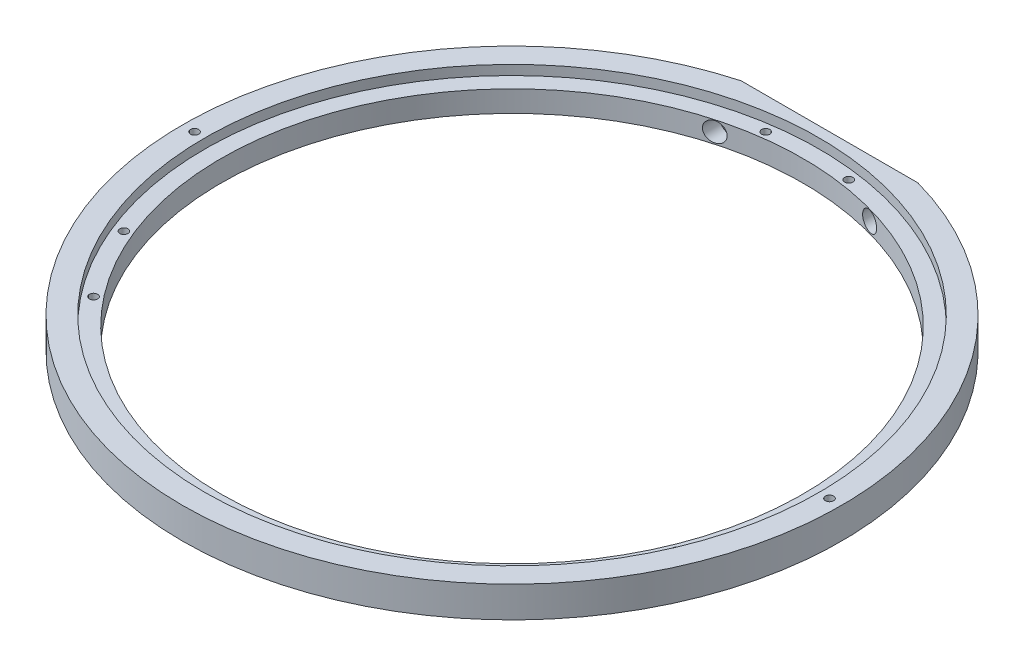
ISO-10303-21;
HEADER;
FILE_DESCRIPTION(('STEP AP214'),'2;1');
FILE_NAME('part.step','',(''),(''),'','','');
FILE_SCHEMA(('AUTOMOTIVE_DESIGN { 1 0 10303 214 1 1 1 1 }'));
ENDSEC;
DATA;
#1=APPLICATION_CONTEXT('core data for automotive mechanical design processes');
#2=APPLICATION_PROTOCOL_DEFINITION('international standard','automotive_design',2000,#1);
#3=PRODUCT_CONTEXT('',#1,'mechanical');
#4=PRODUCT('Part','Part','',(#3));
#5=PRODUCT_RELATED_PRODUCT_CATEGORY('part','',(#4));
#6=PRODUCT_DEFINITION_FORMATION('','',#4);
#7=PRODUCT_DEFINITION_CONTEXT('part definition',#1,'design');
#8=PRODUCT_DEFINITION('design','',#6,#7);
#9=PRODUCT_DEFINITION_SHAPE('','',#8);
#10=(LENGTH_UNIT() NAMED_UNIT(*) SI_UNIT(.MILLI.,.METRE.));
#11=(NAMED_UNIT(*) PLANE_ANGLE_UNIT() SI_UNIT($,.RADIAN.));
#12=(NAMED_UNIT(*) SI_UNIT($,.STERADIAN.) SOLID_ANGLE_UNIT());
#13=UNCERTAINTY_MEASURE_WITH_UNIT(LENGTH_MEASURE(1.E-05),#10,'distance_accuracy_value','');
#14=(GEOMETRIC_REPRESENTATION_CONTEXT(3) GLOBAL_UNCERTAINTY_ASSIGNED_CONTEXT((#13)) GLOBAL_UNIT_ASSIGNED_CONTEXT((#10,
#11,#12)) REPRESENTATION_CONTEXT('',''));
#15=CARTESIAN_POINT('',(0.,0.,0.));
#16=DIRECTION('',(0.,0.,1.));
#17=DIRECTION('',(1.,0.,0.));
#18=AXIS2_PLACEMENT_3D('',#15,#16,#17);
#19=CARTESIAN_POINT('',(0.,-25.4,0.));
#20=DIRECTION('',(0.,1.,0.));
#21=DIRECTION('',(0.,0.,1.));
#22=AXIS2_PLACEMENT_3D('',#19,#20,#21);
#23=CYLINDRICAL_SURFACE('',#22,238.506);
#24=CARTESIAN_POINT('',(-55.5625,-16.51,-231.943787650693));
#25=CARTESIAN_POINT('',(-55.562498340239,-16.7282810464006,-231.943787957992));
#26=CARTESIAN_POINT('',(-55.5715087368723,-16.9465369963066,-231.941630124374));
#27=CARTESIAN_POINT('',(-55.6074758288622,-17.3815515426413,-231.933009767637));
#28=CARTESIAN_POINT('',(-55.6344373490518,-17.5983097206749,-231.926546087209));
#29=CARTESIAN_POINT('',(-55.7061268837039,-18.0289295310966,-231.909337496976));
#30=CARTESIAN_POINT('',(-55.7508738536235,-18.2427878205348,-231.898588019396));
#31=CARTESIAN_POINT('',(-55.8577626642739,-18.6658565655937,-231.872864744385));
#32=CARTESIAN_POINT('',(-55.9199048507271,-18.8750669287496,-231.857890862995));
#33=CARTESIAN_POINT('',(-56.0609996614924,-19.2871500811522,-231.823815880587));
#34=CARTESIAN_POINT('',(-56.1399349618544,-19.4900291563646,-231.804719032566));
#35=CARTESIAN_POINT('',(-56.3140143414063,-19.8882751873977,-231.76249015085));
#36=CARTESIAN_POINT('',(-56.4091586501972,-20.0836420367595,-231.739358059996));
#37=CARTESIAN_POINT('',(-56.6148519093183,-20.465457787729,-231.689192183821));
#38=CARTESIAN_POINT('',(-56.7253944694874,-20.6519103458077,-231.662160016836));
#39=CARTESIAN_POINT('',(-56.9610870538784,-21.0148145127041,-231.604320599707));
#40=CARTESIAN_POINT('',(-57.086242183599,-21.1912625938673,-231.573512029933));
#41=CARTESIAN_POINT('',(-57.351558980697,-21.5347556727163,-231.50794712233));
#42=CARTESIAN_POINT('',(-57.4918650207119,-21.7016818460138,-231.473152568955));
#43=CARTESIAN_POINT('',(-57.7853535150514,-22.0230843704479,-231.40006012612));
#44=CARTESIAN_POINT('',(-57.9385406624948,-22.1775561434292,-231.361760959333));
#45=CARTESIAN_POINT('',(-58.2565837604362,-22.4730194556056,-231.281882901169));
#46=CARTESIAN_POINT('',(-58.4214387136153,-22.6140121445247,-231.240304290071));
#47=CARTESIAN_POINT('',(-58.7616286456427,-22.8817026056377,-231.154091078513));
#48=CARTESIAN_POINT('',(-58.9369640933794,-23.0083997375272,-231.109456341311));
#49=CARTESIAN_POINT('',(-59.3016031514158,-23.2499141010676,-231.016164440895));
#50=CARTESIAN_POINT('',(-59.4911529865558,-23.3643307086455,-230.96743231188));
#51=CARTESIAN_POINT('',(-59.8785932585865,-23.5766912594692,-230.86729118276));
#52=CARTESIAN_POINT('',(-60.0764840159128,-23.6746345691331,-230.815882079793));
#53=CARTESIAN_POINT('',(-60.4791835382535,-23.8535081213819,-230.710692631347));
#54=CARTESIAN_POINT('',(-60.6839918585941,-23.9344394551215,-230.656912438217));
#55=CARTESIAN_POINT('',(-61.0991942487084,-24.0789083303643,-230.547276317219));
#56=CARTESIAN_POINT('',(-61.309590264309,-24.1424397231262,-230.491419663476));
#57=CARTESIAN_POINT('',(-61.7409237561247,-24.2534254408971,-230.376261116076));
#58=CARTESIAN_POINT('',(-61.9619874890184,-24.3003344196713,-230.316906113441));
#59=CARTESIAN_POINT('',(-62.4070027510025,-24.3751250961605,-230.196722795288));
#60=CARTESIAN_POINT('',(-62.6309553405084,-24.4029995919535,-230.135893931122));
#61=CARTESIAN_POINT('',(-63.0800681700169,-24.4395844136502,-230.013197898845));
#62=CARTESIAN_POINT('',(-63.3052280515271,-24.4483001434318,-229.951331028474));
#63=CARTESIAN_POINT('',(-63.7553973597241,-24.4465840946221,-229.826925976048));
#64=CARTESIAN_POINT('',(-63.9804066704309,-24.4361435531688,-229.764387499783));
#65=CARTESIAN_POINT('',(-64.4339558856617,-24.3957264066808,-229.637614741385));
#66=CARTESIAN_POINT('',(-64.662453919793,-24.3652949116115,-229.573375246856));
#67=CARTESIAN_POINT('',(-65.1159065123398,-24.2846871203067,-229.445170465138));
#68=CARTESIAN_POINT('',(-65.3408625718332,-24.2345194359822,-229.381205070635));
#69=CARTESIAN_POINT('',(-65.7858669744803,-24.114724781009,-229.25397559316));
#70=CARTESIAN_POINT('',(-66.0059128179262,-24.0450881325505,-229.190711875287));
#71=CARTESIAN_POINT('',(-66.4393315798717,-23.8868177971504,-229.065445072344));
#72=CARTESIAN_POINT('',(-66.6527070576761,-23.7981915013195,-229.00344150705));
#73=CARTESIAN_POINT('',(-67.0721616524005,-23.602064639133,-228.880940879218));
#74=CARTESIAN_POINT('',(-67.2782084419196,-23.4944905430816,-228.820450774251));
#75=CARTESIAN_POINT('',(-67.6804845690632,-23.261405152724,-228.701788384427));
#76=CARTESIAN_POINT('',(-67.8767177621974,-23.1359009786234,-228.643615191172));
#77=CARTESIAN_POINT('',(-68.2580013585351,-22.8676475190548,-228.530078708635));
#78=CARTESIAN_POINT('',(-68.443047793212,-22.7248921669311,-228.474716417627));
#79=CARTESIAN_POINT('',(-68.800315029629,-22.4231391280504,-228.367387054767));
#80=CARTESIAN_POINT('',(-68.9725412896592,-22.2641484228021,-228.315418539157));
#81=CARTESIAN_POINT('',(-69.2989869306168,-21.9347739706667,-228.216543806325));
#82=CARTESIAN_POINT('',(-69.4535303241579,-21.7647381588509,-228.169548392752));
#83=CARTESIAN_POINT('',(-69.7477167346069,-21.411304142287,-228.079792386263));
#84=CARTESIAN_POINT('',(-69.8873658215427,-21.2279114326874,-228.037030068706));
#85=CARTESIAN_POINT('',(-70.1506035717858,-20.8489632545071,-227.956188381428));
#86=CARTESIAN_POINT('',(-70.2741922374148,-20.6534077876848,-227.918109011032));
#87=CARTESIAN_POINT('',(-70.5041659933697,-20.2515443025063,-227.847073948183));
#88=CARTESIAN_POINT('',(-70.6105517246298,-20.0452366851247,-227.814118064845));
#89=CARTESIAN_POINT('',(-70.8009689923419,-19.6323749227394,-227.755009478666));
#90=CARTESIAN_POINT('',(-70.8857572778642,-19.4262023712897,-227.728627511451));
#91=CARTESIAN_POINT('',(-71.0378437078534,-19.0069075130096,-227.681231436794));
#92=CARTESIAN_POINT('',(-71.105142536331,-18.7937854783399,-227.660217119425));
#93=CARTESIAN_POINT('',(-71.2216021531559,-18.3622176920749,-227.623810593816));
#94=CARTESIAN_POINT('',(-71.2707666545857,-18.1437730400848,-227.608417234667));
#95=CARTESIAN_POINT('',(-71.3504980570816,-17.7031888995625,-227.583435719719));
#96=CARTESIAN_POINT('',(-71.3810654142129,-17.4810495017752,-227.57384742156));
#97=CARTESIAN_POINT('',(-71.4224965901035,-17.0433193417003,-227.560847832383));
#98=CARTESIAN_POINT('',(-71.4340670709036,-16.8278017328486,-227.557215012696));
#99=CARTESIAN_POINT('',(-71.4396179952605,-16.3965201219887,-227.555472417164));
#100=CARTESIAN_POINT('',(-71.4335988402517,-16.1807561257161,-227.557362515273));
#101=CARTESIAN_POINT('',(-71.4040279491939,-15.750573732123,-227.566643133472));
#102=CARTESIAN_POINT('',(-71.3804778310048,-15.5361552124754,-227.574033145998));
#103=CARTESIAN_POINT('',(-71.3160634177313,-15.1101940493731,-227.594227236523));
#104=CARTESIAN_POINT('',(-71.2751990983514,-14.8986514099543,-227.60703132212));
#105=CARTESIAN_POINT('',(-71.1770890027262,-14.4823345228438,-227.637731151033));
#106=CARTESIAN_POINT('',(-71.12003486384,-14.2775106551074,-227.655567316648));
#107=CARTESIAN_POINT('',(-70.9898394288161,-13.8734726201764,-227.696199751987));
#108=CARTESIAN_POINT('',(-70.9166926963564,-13.6742603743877,-227.718997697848));
#109=CARTESIAN_POINT('',(-70.7549519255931,-13.2828633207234,-227.769304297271));
#110=CARTESIAN_POINT('',(-70.6663601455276,-13.0906774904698,-227.796812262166));
#111=CARTESIAN_POINT('',(-70.4744405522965,-12.7145196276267,-227.856260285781));
#112=CARTESIAN_POINT('',(-70.3711120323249,-12.5305479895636,-227.888200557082));
#113=CARTESIAN_POINT('',(-70.1481971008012,-12.1681585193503,-227.956917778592));
#114=CARTESIAN_POINT('',(-70.0283129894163,-11.9899405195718,-227.993782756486));
#115=CARTESIAN_POINT('',(-69.7749653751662,-11.6443422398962,-228.071444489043));
#116=CARTESIAN_POINT('',(-69.641501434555,-11.4769623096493,-228.112241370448));
#117=CARTESIAN_POINT('',(-69.3620064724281,-11.1540327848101,-228.197382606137));
#118=CARTESIAN_POINT('',(-69.2159759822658,-10.9984826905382,-228.241726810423));
#119=CARTESIAN_POINT('',(-68.9123438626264,-10.7000279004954,-228.333585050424));
#120=CARTESIAN_POINT('',(-68.7547381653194,-10.5571276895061,-228.381100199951));
#121=CARTESIAN_POINT('',(-68.4225019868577,-10.2792980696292,-228.480862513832));
#122=CARTESIAN_POINT('',(-68.2474408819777,-10.144924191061,-228.533223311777));
#123=CARTESIAN_POINT('',(-67.8872155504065,-9.89148320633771,-228.640489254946));
#124=CARTESIAN_POINT('',(-67.7020477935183,-9.77242149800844,-228.695395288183));
#125=CARTESIAN_POINT('',(-67.3229474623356,-9.55031322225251,-228.807280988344));
#126=CARTESIAN_POINT('',(-67.1290149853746,-9.44726647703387,-228.864260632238));
#127=CARTESIAN_POINT('',(-66.7336811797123,-9.25774046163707,-228.97984680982));
#128=CARTESIAN_POINT('',(-66.5322796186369,-9.17126170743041,-229.03845339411));
#129=CARTESIAN_POINT('',(-66.1152929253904,-9.01227567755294,-229.159178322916));
#130=CARTESIAN_POINT('',(-65.8994613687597,-8.94045012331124,-229.221344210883));
#131=CARTESIAN_POINT('',(-65.4627195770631,-8.81563811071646,-229.346454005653));
#132=CARTESIAN_POINT('',(-65.2418109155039,-8.76264589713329,-229.409397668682));
#133=CARTESIAN_POINT('',(-64.7962556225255,-8.67576956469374,-229.535641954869));
#134=CARTESIAN_POINT('',(-64.5716073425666,-8.64189411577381,-229.598942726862));
#135=CARTESIAN_POINT('',(-64.120275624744,-8.59351982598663,-229.725395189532));
#136=CARTESIAN_POINT('',(-63.8935928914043,-8.57901451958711,-229.788546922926));
#137=CARTESIAN_POINT('',(-63.4352436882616,-8.56939101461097,-229.915505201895));
#138=CARTESIAN_POINT('',(-63.2035659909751,-8.57465513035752,-229.979300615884));
#139=CARTESIAN_POINT('',(-62.7412762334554,-8.60545007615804,-230.105848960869));
#140=CARTESIAN_POINT('',(-62.5106641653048,-8.63098075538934,-230.168601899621));
#141=CARTESIAN_POINT('',(-62.0521629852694,-8.70221544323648,-230.292634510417));
#142=CARTESIAN_POINT('',(-61.8242739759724,-8.74792020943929,-230.353914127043));
#143=CARTESIAN_POINT('',(-61.3729179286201,-8.85928395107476,-230.474578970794));
#144=CARTESIAN_POINT('',(-61.1494507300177,-8.92494220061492,-230.533964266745));
#145=CARTESIAN_POINT('',(-60.7100957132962,-9.07535857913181,-230.650054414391));
#146=CARTESIAN_POINT('',(-60.4941671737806,-9.15998591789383,-230.706774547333));
#147=CARTESIAN_POINT('',(-60.0700641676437,-9.34807049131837,-230.817563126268));
#148=CARTESIAN_POINT('',(-59.8618867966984,-9.45152058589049,-230.871632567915));
#149=CARTESIAN_POINT('',(-59.4548268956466,-9.67665676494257,-230.976794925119));
#150=CARTESIAN_POINT('',(-59.2559449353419,-9.79834396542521,-231.027887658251));
#151=CARTESIAN_POINT('',(-58.869104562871,-10.0591760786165,-231.126762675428));
#152=CARTESIAN_POINT('',(-58.681145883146,-10.1983205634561,-231.174545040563));
#153=CARTESIAN_POINT('',(-58.3224708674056,-10.4892837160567,-231.265290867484));
#154=CARTESIAN_POINT('',(-58.1514323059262,-10.6406761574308,-231.308347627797));
#155=CARTESIAN_POINT('',(-57.822595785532,-10.9581343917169,-231.390769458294));
#156=CARTESIAN_POINT('',(-57.6647974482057,-11.1241997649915,-231.43013463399));
#157=CARTESIAN_POINT('',(-57.3637372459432,-11.4698881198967,-231.504941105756));
#158=CARTESIAN_POINT('',(-57.2204774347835,-11.6495130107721,-231.540381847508));
#159=CARTESIAN_POINT('',(-56.9497530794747,-12.0210142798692,-231.607117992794));
#160=CARTESIAN_POINT('',(-56.8222879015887,-12.2128901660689,-231.63841356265));
#161=CARTESIAN_POINT('',(-56.5879327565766,-12.601406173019,-231.695774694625));
#162=CARTESIAN_POINT('',(-56.4805302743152,-12.7977179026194,-231.721971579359));
#163=CARTESIAN_POINT('',(-56.2825156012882,-13.199123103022,-231.77014661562));
#164=CARTESIAN_POINT('',(-56.1919026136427,-13.404216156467,-231.792124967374));
#165=CARTESIAN_POINT('',(-56.0283387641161,-13.8214452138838,-231.831715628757));
#166=CARTESIAN_POINT('',(-55.9553661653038,-14.033572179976,-231.849333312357));
#167=CARTESIAN_POINT('',(-55.827589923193,-14.4634642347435,-231.880134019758));
#168=CARTESIAN_POINT('',(-55.7727809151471,-14.6812276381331,-231.893318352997));
#169=CARTESIAN_POINT('',(-55.672592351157,-15.1652481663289,-231.917394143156));
#170=CARTESIAN_POINT('',(-55.6313488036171,-15.4324218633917,-231.927285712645));
#171=CARTESIAN_POINT('',(-55.5763038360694,-15.9697432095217,-231.940482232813));
#172=CARTESIAN_POINT('',(-55.5625020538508,-16.2398908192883,-231.94378727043));
#173=CARTESIAN_POINT('',(-55.5625,-16.51,-231.943787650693));
#174=B_SPLINE_CURVE_WITH_KNOTS('',3,(#24,#25,#26,#27,#28,#29,#30,#31,#32,#33,#34,#35,#36,#37,
#38,#39,#40,#41,#42,#43,#44,#45,#46,#47,#48,#49,#50,#51,#52,#53,#54,#55,#56,#57,#58,#59,#60,#61,
#62,#63,#64,#65,#66,#67,#68,#69,#70,#71,#72,#73,#74,#75,#76,#77,#78,#79,#80,#81,#82,#83,#84,#85,
#86,#87,#88,#89,#90,#91,#92,#93,#94,#95,#96,#97,#98,#99,#100,#101,#102,#103,#104,#105,#106,#107,
#108,#109,#110,#111,#112,#113,#114,#115,#116,#117,#118,#119,#120,#121,#122,#123,#124,#125,#126,
#127,#128,#129,#130,#131,#132,#133,#134,#135,#136,#137,#138,#139,#140,#141,#142,#143,#144,#145,
#146,#147,#148,#149,#150,#151,#152,#153,#154,#155,#156,#157,#158,#159,#160,#161,#162,#163,#164,
#165,#166,#167,#168,#169,#170,#171,#172,#173),.UNSPECIFIED.,.T.,.F.,(4,2,2,2,2,2,2,2,2,2,2,2,2,
2,2,2,2,2,2,2,2,2,2,2,2,2,2,2,2,2,2,2,2,2,2,2,2,2,2,2,2,2,2,2,2,2,2,2,2,2,2,2,2,2,2,2,2,2,2,2,2,
2,2,2,2,2,2,2,2,2,2,2,2,2,4),(0.,0.654603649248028,1.30938331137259,1.96486270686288,
2.62035513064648,3.27517459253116,3.93000333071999,4.58456112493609,5.23934830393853,
5.90104262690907,6.56297908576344,7.22485903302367,7.88676861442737,8.56610595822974,
9.24546942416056,9.92478930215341,10.6043489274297,11.3044952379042,12.004906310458,
12.7051198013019,13.4056536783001,14.1227074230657,14.8394486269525,15.5565467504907,
16.2733662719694,16.9930313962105,17.712411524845,18.432045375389,19.1513710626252,
19.8540835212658,20.5565084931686,21.2589333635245,21.9613320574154,22.6339391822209,
23.3065199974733,23.9789630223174,24.6513895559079,25.2981839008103,25.9449634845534,
26.5916833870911,27.238404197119,27.8777681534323,28.5173484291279,29.1568352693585,
29.7963527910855,30.4493996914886,31.1024676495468,31.7555080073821,32.4087789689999,
33.088451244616,33.7683624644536,34.4482661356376,35.1281909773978,35.8348066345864,
36.5412061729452,37.247925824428,37.9544095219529,38.67462539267,39.3948359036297,
40.1150734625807,40.8352848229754,41.550675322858,42.2657950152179,42.9809584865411,
43.6961044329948,44.3925619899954,45.0889996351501,45.7855355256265,46.4820434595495,
47.1571144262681,47.8321533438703,48.5063561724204,49.1803596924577,49.9904015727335,
50.8004327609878),.UNSPECIFIED.);
#175=CARTESIAN_POINT('',(-55.5625,-16.51,-231.943787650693));
#176=VERTEX_POINT('',#175);
#177=EDGE_CURVE('E99',#176,#176,#174,.T.);
#178=ORIENTED_EDGE('',*,*,#177,.T.);
#179=EDGE_LOOP('',(#178));
#180=FACE_BOUND('',#179,.T.);
#181=CARTESIAN_POINT('',(0.,-25.4,0.));
#182=DIRECTION('',(0.,1.,0.));
#183=DIRECTION('',(0.,0.,1.));
#184=AXIS2_PLACEMENT_3D('',#181,#182,#183);
#185=CIRCLE('',#184,238.506);
#186=CARTESIAN_POINT('',(0.,-25.4,238.506));
#187=VERTEX_POINT('',#186);
#188=EDGE_CURVE('E83',#187,#187,#185,.T.);
#189=ORIENTED_EDGE('',*,*,#188,.F.);
#190=EDGE_LOOP('',(#189));
#191=FACE_BOUND('',#190,.T.);
#192=CARTESIAN_POINT('',(0.,-7.9248,0.));
#193=DIRECTION('',(0.,1.,0.));
#194=DIRECTION('',(0.,0.,1.));
#195=AXIS2_PLACEMENT_3D('',#192,#193,#194);
#196=CIRCLE('',#195,238.506);
#197=CARTESIAN_POINT('',(0.,-7.9248,238.506));
#198=VERTEX_POINT('',#197);
#199=EDGE_CURVE('E181',#198,#198,#196,.F.);
#200=ORIENTED_EDGE('',*,*,#199,.F.);
#201=EDGE_LOOP('',(#200));
#202=FACE_BOUND('',#201,.T.);
#203=CARTESIAN_POINT('',(71.4375,-16.51,-227.556137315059));
#204=CARTESIAN_POINT('',(71.4375017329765,-16.2943147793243,-227.556136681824));
#205=CARTESIAN_POINT('',(71.4287036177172,-16.0786543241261,-227.558899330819));
#206=CARTESIAN_POINT('',(71.3935919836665,-15.6488338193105,-227.569917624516));
#207=CARTESIAN_POINT('',(71.3672736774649,-15.4346741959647,-227.578174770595));
#208=CARTESIAN_POINT('',(71.2973192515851,-15.0092525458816,-227.600100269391));
#209=CARTESIAN_POINT('',(71.2536646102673,-14.7979938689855,-227.613774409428));
#210=CARTESIAN_POINT('',(71.1494327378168,-14.380103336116,-227.646377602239));
#211=CARTESIAN_POINT('',(71.0888550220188,-14.1734716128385,-227.665306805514));
#212=CARTESIAN_POINT('',(70.9514221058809,-13.7665983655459,-227.70817487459));
#213=CARTESIAN_POINT('',(70.8745925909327,-13.5663473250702,-227.732105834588));
#214=CARTESIAN_POINT('',(70.7052571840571,-13.1732382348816,-227.78473719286));
#215=CARTESIAN_POINT('',(70.6127510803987,-12.9803802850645,-227.813437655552));
#216=CARTESIAN_POINT('',(70.412866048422,-12.6033781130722,-227.87529762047));
#217=CARTESIAN_POINT('',(70.3054926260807,-12.4192306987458,-227.90845547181));
#218=CARTESIAN_POINT('',(70.0766620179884,-12.0606544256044,-227.978919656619));
#219=CARTESIAN_POINT('',(69.9551998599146,-11.8862290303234,-228.016227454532));
#220=CARTESIAN_POINT('',(69.6965008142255,-11.5447087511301,-228.095437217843));
#221=CARTESIAN_POINT('',(69.5589897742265,-11.3778398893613,-228.137418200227));
#222=CARTESIAN_POINT('',(69.2712892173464,-11.0563146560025,-228.224939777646));
#223=CARTESIAN_POINT('',(69.1210950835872,-10.9016627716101,-228.270481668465));
#224=CARTESIAN_POINT('',(68.8091962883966,-10.6055462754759,-228.364693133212));
#225=CARTESIAN_POINT('',(68.6474938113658,-10.4640791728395,-228.413362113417));
#226=CARTESIAN_POINT('',(68.3136230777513,-10.195023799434,-228.513437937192));
#227=CARTESIAN_POINT('',(68.141450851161,-10.0674408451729,-228.564845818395));
#228=CARTESIAN_POINT('',(67.7803669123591,-9.82179853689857,-228.672190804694));
#229=CARTESIAN_POINT('',(67.591055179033,-9.70437037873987,-228.728227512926));
#230=CARTESIAN_POINT('',(67.2036279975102,-9.48600420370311,-228.842358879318));
#231=CARTESIAN_POINT('',(67.0055086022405,-9.38507367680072,-228.900454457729));
#232=CARTESIAN_POINT('',(66.6019104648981,-9.20032767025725,-229.018212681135));
#233=CARTESIAN_POINT('',(66.3964321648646,-9.1165111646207,-229.077875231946));
#234=CARTESIAN_POINT('',(65.9794737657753,-8.96644560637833,-229.198316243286));
#235=CARTESIAN_POINT('',(65.7679935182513,-8.90019698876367,-229.259094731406));
#236=CARTESIAN_POINT('',(65.3329762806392,-8.78364538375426,-229.383450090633));
#237=CARTESIAN_POINT('',(65.1092757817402,-8.73397718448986,-229.447050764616));
#238=CARTESIAN_POINT('',(64.6585661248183,-8.65417467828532,-229.57446872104));
#239=CARTESIAN_POINT('',(64.4315581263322,-8.62403368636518,-229.638285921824));
#240=CARTESIAN_POINT('',(63.9756225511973,-8.58345647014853,-229.765723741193));
#241=CARTESIAN_POINT('',(63.746694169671,-8.5730289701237,-229.829344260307));
#242=CARTESIAN_POINT('',(63.2886859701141,-8.57201045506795,-229.95588857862));
#243=CARTESIAN_POINT('',(63.0596062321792,-8.58141255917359,-230.018812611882));
#244=CARTESIAN_POINT('',(62.6001781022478,-8.62026091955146,-230.144274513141));
#245=CARTESIAN_POINT('',(62.3698456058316,-8.64993737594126,-230.206799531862));
#246=CARTESIAN_POINT('',(61.9122624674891,-8.72945239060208,-230.330284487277));
#247=CARTESIAN_POINT('',(61.685011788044,-8.77929070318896,-230.391244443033));
#248=CARTESIAN_POINT('',(61.2352745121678,-8.89888537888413,-230.511187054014));
#249=CARTESIAN_POINT('',(61.0127879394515,-8.96864184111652,-230.570169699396));
#250=CARTESIAN_POINT('',(60.5742809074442,-9.12769234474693,-230.685760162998));
#251=CARTESIAN_POINT('',(60.3582601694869,-9.21698554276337,-230.742368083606));
#252=CARTESIAN_POINT('',(59.937273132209,-9.4132346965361,-230.852078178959));
#253=CARTESIAN_POINT('',(59.7321958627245,-9.51993164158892,-230.905217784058));
#254=CARTESIAN_POINT('',(59.3316448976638,-9.75114107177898,-231.008464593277));
#255=CARTESIAN_POINT('',(59.1361675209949,-9.87564665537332,-231.058572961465));
#256=CARTESIAN_POINT('',(58.7562911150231,-10.1417260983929,-231.155464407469));
#257=CARTESIAN_POINT('',(58.5718929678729,-10.2833013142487,-231.202247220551));
#258=CARTESIAN_POINT('',(58.2157227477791,-10.5825704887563,-231.292186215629));
#259=CARTESIAN_POINT('',(58.0439503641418,-10.7402640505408,-231.33534248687));
#260=CARTESIAN_POINT('',(57.7192977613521,-11.0658571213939,-231.416554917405));
#261=CARTESIAN_POINT('',(57.5660128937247,-11.2333253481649,-231.454723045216));
#262=CARTESIAN_POINT('',(57.2739886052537,-11.5812809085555,-231.527158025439));
#263=CARTESIAN_POINT('',(57.1352487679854,-11.7617678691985,-231.561424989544));
#264=CARTESIAN_POINT('',(56.8735021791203,-12.1344679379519,-231.625851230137));
#265=CARTESIAN_POINT('',(56.7504933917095,-12.3266795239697,-231.656011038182));
#266=CARTESIAN_POINT('',(56.5212524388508,-12.7214535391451,-231.712049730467));
#267=CARTESIAN_POINT('',(56.4150199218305,-12.9240157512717,-231.737928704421));
#268=CARTESIAN_POINT('',(56.2232126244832,-13.3317172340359,-231.784537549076));
#269=CARTESIAN_POINT('',(56.1371103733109,-13.536593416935,-231.805399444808));
#270=CARTESIAN_POINT('',(55.9822874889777,-13.9531891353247,-231.842838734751));
#271=CARTESIAN_POINT('',(55.9135664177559,-14.1649084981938,-231.859416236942));
#272=CARTESIAN_POINT('',(55.7940975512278,-14.5936265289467,-231.888193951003));
#273=CARTESIAN_POINT('',(55.7433478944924,-14.810624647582,-231.900394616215));
#274=CARTESIAN_POINT('',(55.6602499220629,-15.2483174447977,-231.920353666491));
#275=CARTESIAN_POINT('',(55.6279014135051,-15.4690120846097,-231.928112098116));
#276=CARTESIAN_POINT('',(55.5823586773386,-15.9078934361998,-231.939030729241));
#277=CARTESIAN_POINT('',(55.5687846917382,-16.1260385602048,-231.942282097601));
#278=CARTESIAN_POINT('',(55.5596713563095,-16.5627249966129,-231.944465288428));
#279=CARTESIAN_POINT('',(55.5641317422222,-16.781266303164,-231.943397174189));
#280=CARTESIAN_POINT('',(55.5910487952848,-17.2171616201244,-231.936947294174));
#281=CARTESIAN_POINT('',(55.6135045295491,-17.4345156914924,-231.931565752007));
#282=CARTESIAN_POINT('',(55.6762235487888,-17.8664887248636,-231.916517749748));
#283=CARTESIAN_POINT('',(55.7164868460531,-18.0811076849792,-231.906851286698));
#284=CARTESIAN_POINT('',(55.8142007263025,-18.5048423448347,-231.883353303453));
#285=CARTESIAN_POINT('',(55.8715499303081,-18.7139828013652,-231.869546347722));
#286=CARTESIAN_POINT('',(56.0030735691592,-19.1266614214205,-231.837814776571));
#287=CARTESIAN_POINT('',(56.0772537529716,-19.3301976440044,-231.819888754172));
#288=CARTESIAN_POINT('',(56.2418159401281,-19.7301591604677,-231.780019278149));
#289=CARTESIAN_POINT('',(56.3321950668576,-19.926585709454,-231.7580765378));
#290=CARTESIAN_POINT('',(56.5284489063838,-20.3110479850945,-231.710286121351));
#291=CARTESIAN_POINT('',(56.6343241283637,-20.4990834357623,-231.684438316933));
#292=CARTESIAN_POINT('',(56.8618760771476,-20.8673541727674,-231.628696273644));
#293=CARTESIAN_POINT('',(56.9837004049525,-21.0474925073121,-231.598764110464));
#294=CARTESIAN_POINT('',(57.2413621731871,-21.3967633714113,-231.53521566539));
#295=CARTESIAN_POINT('',(57.3771999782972,-21.5658956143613,-231.501599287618));
#296=CARTESIAN_POINT('',(57.6618314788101,-21.8920570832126,-231.430868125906));
#297=CARTESIAN_POINT('',(57.8106236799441,-22.0490877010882,-231.393753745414));
#298=CARTESIAN_POINT('',(58.1201195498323,-22.3501556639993,-231.316210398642));
#299=CARTESIAN_POINT('',(58.280827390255,-22.4941884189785,-231.275780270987));
#300=CARTESIAN_POINT('',(58.6167376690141,-22.7714825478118,-231.190875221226));
#301=CARTESIAN_POINT('',(58.7921874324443,-22.9044225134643,-231.146328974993));
#302=CARTESIAN_POINT('',(59.1530411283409,-23.1550076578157,-231.054245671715));
#303=CARTESIAN_POINT('',(59.3384487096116,-23.2726471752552,-231.006707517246));
#304=CARTESIAN_POINT('',(59.7178041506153,-23.4918974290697,-230.90893066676));
#305=CARTESIAN_POINT('',(59.9117512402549,-23.5935096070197,-230.858692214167));
#306=CARTESIAN_POINT('',(60.3068466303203,-23.7801732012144,-230.755797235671));
#307=CARTESIAN_POINT('',(60.5079952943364,-23.865223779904,-230.703140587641));
#308=CARTESIAN_POINT('',(60.9222999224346,-24.0206450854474,-230.594086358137));
#309=CARTESIAN_POINT('',(61.1356350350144,-24.0904929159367,-230.537623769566));
#310=CARTESIAN_POINT('',(61.5669798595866,-24.2117878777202,-230.422804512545));
#311=CARTESIAN_POINT('',(61.7849897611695,-24.2632342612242,-230.364447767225));
#312=CARTESIAN_POINT('',(62.2241974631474,-24.3474893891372,-230.246200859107));
#313=CARTESIAN_POINT('',(62.4453956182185,-24.3802960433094,-230.186310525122));
#314=CARTESIAN_POINT('',(62.8894613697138,-24.4271332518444,-230.065383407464));
#315=CARTESIAN_POINT('',(63.1123290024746,-24.4411633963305,-230.004346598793));
#316=CARTESIAN_POINT('',(63.5643331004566,-24.4505445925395,-229.879846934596));
#317=CARTESIAN_POINT('',(63.7934747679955,-24.4453757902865,-229.816363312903));
#318=CARTESIAN_POINT('',(64.2503556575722,-24.4152694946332,-229.689050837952));
#319=CARTESIAN_POINT('',(64.478094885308,-24.390332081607,-229.625221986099));
#320=CARTESIAN_POINT('',(64.9306276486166,-24.320865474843,-229.497670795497));
#321=CARTESIAN_POINT('',(65.1554208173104,-24.2763338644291,-229.433948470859));
#322=CARTESIAN_POINT('',(65.6004689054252,-24.1679624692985,-229.307095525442));
#323=CARTESIAN_POINT('',(65.8207239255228,-24.1041231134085,-229.243964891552));
#324=CARTESIAN_POINT('',(66.2576478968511,-23.9566804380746,-229.118066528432));
#325=CARTESIAN_POINT('',(66.4742470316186,-23.8728594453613,-229.055311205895));
#326=CARTESIAN_POINT('',(66.8995745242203,-23.6863985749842,-228.931448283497));
#327=CARTESIAN_POINT('',(67.1083058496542,-23.5837658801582,-228.870340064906));
#328=CARTESIAN_POINT('',(67.5165023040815,-23.3602394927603,-228.750255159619));
#329=CARTESIAN_POINT('',(67.7159640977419,-23.2393392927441,-228.69127924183));
#330=CARTESIAN_POINT('',(68.1039256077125,-22.9800989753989,-228.576044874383));
#331=CARTESIAN_POINT('',(68.2924298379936,-22.8417661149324,-228.519785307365));
#332=CARTESIAN_POINT('',(68.6543962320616,-22.5506341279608,-228.411298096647));
#333=CARTESIAN_POINT('',(68.8280376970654,-22.3980754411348,-228.35902361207));
#334=CARTESIAN_POINT('',(69.1618269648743,-22.0778618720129,-228.258152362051));
#335=CARTESIAN_POINT('',(69.3219801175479,-21.9102130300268,-228.209554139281));
#336=CARTESIAN_POINT('',(69.6275592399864,-21.5608220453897,-228.116506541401));
#337=CARTESIAN_POINT('',(69.7729806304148,-21.379075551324,-228.072058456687));
#338=CARTESIAN_POINT('',(70.0477416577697,-21.0027995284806,-227.987821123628));
#339=CARTESIAN_POINT('',(70.1770821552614,-20.8082706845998,-227.948031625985));
#340=CARTESIAN_POINT('',(70.4139136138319,-20.415419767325,-227.874982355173));
#341=CARTESIAN_POINT('',(70.5220460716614,-20.2175196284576,-227.841532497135));
#342=CARTESIAN_POINT('',(70.7213371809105,-19.8125915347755,-227.779751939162));
#343=CARTESIAN_POINT('',(70.8124968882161,-19.6055641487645,-227.751420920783));
#344=CARTESIAN_POINT('',(70.9768808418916,-19.1841786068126,-227.700245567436));
#345=CARTESIAN_POINT('',(71.0501297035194,-18.969830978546,-227.677393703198));
#346=CARTESIAN_POINT('',(71.1781244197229,-18.5352444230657,-227.637411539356));
#347=CARTESIAN_POINT('',(71.232876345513,-18.3150074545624,-227.620279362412));
#348=CARTESIAN_POINT('',(71.3309971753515,-17.8327588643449,-227.589551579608));
#349=CARTESIAN_POINT('',(71.370891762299,-17.5699631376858,-227.577038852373));
#350=CARTESIAN_POINT('',(71.424141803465,-17.0414323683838,-227.560332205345));
#351=CARTESIAN_POINT('',(71.4374978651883,-16.7756973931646,-227.556138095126));
#352=CARTESIAN_POINT('',(71.4375,-16.51,-227.556137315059));
#353=B_SPLINE_CURVE_WITH_KNOTS('',3,(#203,#204,#205,#206,#207,#208,#209,#210,#211,#212,#213,
#214,#215,#216,#217,#218,#219,#220,#221,#222,#223,#224,#225,#226,#227,#228,#229,#230,#231,#232,
#233,#234,#235,#236,#237,#238,#239,#240,#241,#242,#243,#244,#245,#246,#247,#248,#249,#250,#251,
#252,#253,#254,#255,#256,#257,#258,#259,#260,#261,#262,#263,#264,#265,#266,#267,#268,#269,#270,
#271,#272,#273,#274,#275,#276,#277,#278,#279,#280,#281,#282,#283,#284,#285,#286,#287,#288,#289,
#290,#291,#292,#293,#294,#295,#296,#297,#298,#299,#300,#301,#302,#303,#304,#305,#306,#307,#308,
#309,#310,#311,#312,#313,#314,#315,#316,#317,#318,#319,#320,#321,#322,#323,#324,#325,#326,#327,
#328,#329,#330,#331,#332,#333,#334,#335,#336,#337,#338,#339,#340,#341,#342,#343,#344,#345,#346,
#347,#348,#349,#350,#351,#352),.UNSPECIFIED.,.T.,.F.,(4,2,2,2,2,2,2,2,2,2,2,2,2,2,2,2,2,2,2,2,2,
2,2,2,2,2,2,2,2,2,2,2,2,2,2,2,2,2,2,2,2,2,2,2,2,2,2,2,2,2,2,2,2,2,2,2,2,2,2,2,2,2,2,2,2,2,2,2,2,
2,2,2,2,2,4),(0.,0.646816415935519,1.29380964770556,1.94149597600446,2.58920085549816,
3.23588960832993,3.88258709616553,4.52904572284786,5.17573320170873,5.8357867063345,
6.49608152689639,7.15625134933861,7.81667308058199,8.50503275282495,9.19370407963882,
9.88233410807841,10.5709811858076,11.283581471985,11.9959376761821,12.7086090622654,
13.4210331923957,14.1416838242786,14.8623256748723,15.5829711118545,16.3035854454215,
17.014317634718,17.724775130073,18.4352891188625,19.1457856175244,19.8355790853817,
20.5253527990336,21.2150371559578,21.9047070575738,22.5735249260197,23.2423259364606,
23.9110576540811,24.579782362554,25.2347723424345,25.8897527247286,26.5446991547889,
27.1996460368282,27.850781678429,28.5021400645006,29.1533828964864,29.8046471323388,
30.4624322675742,31.1202345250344,31.7779610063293,32.4359188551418,33.1089140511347,
33.7821575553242,34.4553404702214,35.1285574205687,35.8221732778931,36.5158173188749,
37.2095391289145,37.9032760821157,38.6159327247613,39.3285864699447,40.04132813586,
40.7540539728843,41.4749306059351,42.1955325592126,42.9163918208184,43.6369519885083,
44.3470019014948,45.0567688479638,45.7667557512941,46.4767046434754,47.1597944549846,
47.8428417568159,48.5249449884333,49.2068241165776,50.0036398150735,50.8004372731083),.UNSPECIFIED.);
#354=CARTESIAN_POINT('',(71.4375,-16.51,-227.556137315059));
#355=VERTEX_POINT('',#354);
#356=EDGE_CURVE('E42',#355,#355,#353,.T.);
#357=ORIENTED_EDGE('',*,*,#356,.F.);
#358=EDGE_LOOP('',(#357));
#359=FACE_BOUND('',#358,.T.);
#360=ADVANCED_FACE('F38',(#180,#191,#202,#359),#23,.F.);
#361=CARTESIAN_POINT('',(63.5,-16.51,-224.79));
#362=DIRECTION('',(0.,0.,-1.));
#363=DIRECTION('',(-1.,0.,0.));
#364=AXIS2_PLACEMENT_3D('',#361,#362,#363);
#365=CYLINDRICAL_SURFACE('',#364,3.37819999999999);
#366=CARTESIAN_POINT('',(63.5,-16.51,-260.35));
#367=DIRECTION('',(0.,0.,1.));
#368=DIRECTION('',(1.,0.,0.));
#369=AXIS2_PLACEMENT_3D('',#366,#367,#368);
#370=CIRCLE('',#369,3.37819999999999);
#371=CARTESIAN_POINT('',(60.1218,-16.51,-260.35));
#372=VERTEX_POINT('',#371);
#373=EDGE_CURVE('E185',#372,#372,#370,.T.);
#374=CARTESIAN_POINT('',(63.5,-16.51,-241.935));
#375=DIRECTION('',(0.,0.,1.));
#376=DIRECTION('',(1.,0.,0.));
#377=AXIS2_PLACEMENT_3D('',#374,#375,#376);
#378=CIRCLE('',#377,3.37819999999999);
#379=CARTESIAN_POINT('',(60.1218,-16.51,-241.935));
#380=VERTEX_POINT('',#379);
#381=EDGE_CURVE('E105',#380,#380,#378,.T.);
#382=CARTESIAN_POINT('',(60.1218,-16.51,-260.35));
#383=CARTESIAN_POINT('',(60.1218,-16.51,-260.158177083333));
#384=CARTESIAN_POINT('',(60.1218,-16.51,-259.966354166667));
#385=CARTESIAN_POINT('',(60.1218,-16.51,-259.582708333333));
#386=CARTESIAN_POINT('',(60.1218,-16.51,-259.390885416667));
#387=CARTESIAN_POINT('',(60.1218,-16.51,-259.007239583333));
#388=CARTESIAN_POINT('',(60.1218,-16.51,-258.815416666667));
#389=CARTESIAN_POINT('',(60.1218,-16.51,-258.431770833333));
#390=CARTESIAN_POINT('',(60.1218,-16.51,-258.239947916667));
#391=CARTESIAN_POINT('',(60.1218,-16.51,-257.856302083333));
#392=CARTESIAN_POINT('',(60.1218,-16.51,-257.664479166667));
#393=CARTESIAN_POINT('',(60.1218,-16.51,-257.280833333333));
#394=CARTESIAN_POINT('',(60.1218,-16.51,-257.089010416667));
#395=CARTESIAN_POINT('',(60.1218,-16.51,-256.705364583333));
#396=CARTESIAN_POINT('',(60.1218,-16.51,-256.513541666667));
#397=CARTESIAN_POINT('',(60.1218,-16.51,-256.129895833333));
#398=CARTESIAN_POINT('',(60.1218,-16.51,-255.938072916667));
#399=CARTESIAN_POINT('',(60.1218,-16.51,-255.554427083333));
#400=CARTESIAN_POINT('',(60.1218,-16.51,-255.362604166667));
#401=CARTESIAN_POINT('',(60.1218,-16.51,-254.978958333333));
#402=CARTESIAN_POINT('',(60.1218,-16.51,-254.787135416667));
#403=CARTESIAN_POINT('',(60.1218,-16.51,-254.403489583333));
#404=CARTESIAN_POINT('',(60.1218,-16.51,-254.211666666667));
#405=CARTESIAN_POINT('',(60.1218,-16.51,-253.828020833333));
#406=CARTESIAN_POINT('',(60.1218,-16.51,-253.636197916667));
#407=CARTESIAN_POINT('',(60.1218,-16.51,-253.252552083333));
#408=CARTESIAN_POINT('',(60.1218,-16.51,-253.060729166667));
#409=CARTESIAN_POINT('',(60.1218,-16.51,-252.677083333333));
#410=CARTESIAN_POINT('',(60.1218,-16.51,-252.485260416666));
#411=CARTESIAN_POINT('',(60.1218,-16.51,-252.101614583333));
#412=CARTESIAN_POINT('',(60.1218,-16.51,-251.909791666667));
#413=CARTESIAN_POINT('',(60.1218,-16.51,-251.526145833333));
#414=CARTESIAN_POINT('',(60.1218,-16.51,-251.334322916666));
#415=CARTESIAN_POINT('',(60.1218,-16.51,-250.950677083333));
#416=CARTESIAN_POINT('',(60.1218,-16.51,-250.758854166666));
#417=CARTESIAN_POINT('',(60.1218,-16.51,-250.375208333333));
#418=CARTESIAN_POINT('',(60.1218,-16.51,-250.183385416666));
#419=CARTESIAN_POINT('',(60.1218,-16.51,-249.799739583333));
#420=CARTESIAN_POINT('',(60.1218,-16.51,-249.607916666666));
#421=CARTESIAN_POINT('',(60.1218,-16.51,-249.224270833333));
#422=CARTESIAN_POINT('',(60.1218,-16.51,-249.032447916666));
#423=CARTESIAN_POINT('',(60.1218,-16.51,-248.648802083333));
#424=CARTESIAN_POINT('',(60.1218,-16.51,-248.456979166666));
#425=CARTESIAN_POINT('',(60.1218,-16.51,-248.073333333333));
#426=CARTESIAN_POINT('',(60.1218,-16.51,-247.881510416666));
#427=CARTESIAN_POINT('',(60.1218,-16.51,-247.497864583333));
#428=CARTESIAN_POINT('',(60.1218,-16.51,-247.306041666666));
#429=CARTESIAN_POINT('',(60.1218,-16.51,-246.922395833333));
#430=CARTESIAN_POINT('',(60.1218,-16.51,-246.730572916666));
#431=CARTESIAN_POINT('',(60.1218,-16.51,-246.346927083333));
#432=CARTESIAN_POINT('',(60.1218,-16.51,-246.155104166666));
#433=CARTESIAN_POINT('',(60.1218,-16.51,-245.771458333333));
#434=CARTESIAN_POINT('',(60.1218,-16.51,-245.579635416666));
#435=CARTESIAN_POINT('',(60.1218,-16.51,-245.195989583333));
#436=CARTESIAN_POINT('',(60.1218,-16.51,-245.004166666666));
#437=CARTESIAN_POINT('',(60.1218,-16.51,-244.620520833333));
#438=CARTESIAN_POINT('',(60.1218,-16.51,-244.428697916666));
#439=CARTESIAN_POINT('',(60.1218,-16.51,-244.045052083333));
#440=CARTESIAN_POINT('',(60.1218,-16.51,-243.853229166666));
#441=CARTESIAN_POINT('',(60.1218,-16.51,-243.469583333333));
#442=CARTESIAN_POINT('',(60.1218,-16.51,-243.277760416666));
#443=CARTESIAN_POINT('',(60.1218,-16.51,-242.894114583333));
#444=CARTESIAN_POINT('',(60.1218,-16.51,-242.702291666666));
#445=CARTESIAN_POINT('',(60.1218,-16.51,-242.318645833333));
#446=CARTESIAN_POINT('',(60.1218,-16.51,-242.126822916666));
#447=CARTESIAN_POINT('',(60.1218,-16.51,-241.935));
#448=B_SPLINE_CURVE_WITH_KNOTS('',3,(#382,#383,#384,#385,#386,#387,#388,#389,#390,#391,#392,
#393,#394,#395,#396,#397,#398,#399,#400,#401,#402,#403,#404,#405,#406,#407,#408,#409,#410,#411,
#412,#413,#414,#415,#416,#417,#418,#419,#420,#421,#422,#423,#424,#425,#426,#427,#428,#429,#430,
#431,#432,#433,#434,#435,#436,#437,#438,#439,#440,#441,#442,#443,#444,#445,#446,#447),
.UNSPECIFIED.,.F.,.F.,(4,2,2,2,2,2,2,2,2,2,2,2,2,2,2,2,2,2,2,2,2,2,2,2,2,2,2,2,2,2,2,2,4),(0.,
0.57546875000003,1.15093750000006,1.72640625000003,2.30187500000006,2.87734375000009,
3.45281250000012,4.0282812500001,4.60375000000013,5.17921875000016,5.75468750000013,
6.33015625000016,6.90562500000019,7.48109375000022,8.0565625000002,8.63203125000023,
9.20750000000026,9.78296875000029,10.3584375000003,10.9339062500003,11.5093750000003,
12.0848437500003,12.6603125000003,13.2357812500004,13.8112500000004,14.3867187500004,
14.9621875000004,15.5376562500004,16.1131250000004,16.6885937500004,17.2640625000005,
17.8395312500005,18.4150000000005),.UNSPECIFIED.);
#449=EDGE_CURVE('BSEAM125',#372,#380,#448,.T.);
#450=ORIENTED_EDGE('',*,*,#373,.F.);
#451=ORIENTED_EDGE('',*,*,#381,.T.);
#452=ORIENTED_EDGE('',*,*,#449,.T.);
#453=ORIENTED_EDGE('',*,*,#449,.F.);
#454=EDGE_LOOP('',(#450,#452,#451,#453));
#455=FACE_BOUND('',#454,.T.);
#456=ADVANCED_FACE('F125',(#455),#365,.F.);
#457=CARTESIAN_POINT('',(-107.538254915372,-25.4,-260.35));
#458=DIRECTION('',(0.,0.,1.));
#459=DIRECTION('',(1.,0.,0.));
#460=AXIS2_PLACEMENT_3D('',#457,#458,#459);
#461=PLANE('',#460);
#462=DIRECTION('',(0.,1.,0.));
#463=VECTOR('',#462,1.);
#464=CARTESIAN_POINT('',(72.4995381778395,-25.4,-260.35));
#465=LINE('',#464,#463);
#466=CARTESIAN_POINT('',(72.4995381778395,0.,-260.35));
#467=VERTEX_POINT('',#466);
#468=CARTESIAN_POINT('',(72.4995381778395,-25.4,-260.35));
#469=VERTEX_POINT('',#468);
#470=EDGE_CURVE('E11',#467,#469,#465,.F.);
#471=ORIENTED_EDGE('',*,*,#470,.T.);
#472=DIRECTION('',(1.,0.,0.));
#473=VECTOR('',#472,1.);
#474=CARTESIAN_POINT('',(-107.538254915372,-25.4,-260.35));
#475=LINE('',#474,#473);
#476=CARTESIAN_POINT('',(-72.4995381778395,-25.4,-260.35));
#477=VERTEX_POINT('',#476);
#478=EDGE_CURVE('E58',#477,#469,#475,.T.);
#479=ORIENTED_EDGE('',*,*,#478,.F.);
#480=DIRECTION('',(0.,1.,0.));
#481=VECTOR('',#480,1.);
#482=CARTESIAN_POINT('',(-72.4995381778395,-25.4,-260.35));
#483=LINE('',#482,#481);
#484=CARTESIAN_POINT('',(-72.4995381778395,0.,-260.35));
#485=VERTEX_POINT('',#484);
#486=EDGE_CURVE('E51',#477,#485,#483,.T.);
#487=ORIENTED_EDGE('',*,*,#486,.T.);
#488=DIRECTION('',(1.,0.,0.));
#489=VECTOR('',#488,1.);
#490=CARTESIAN_POINT('',(-107.538254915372,0.,-260.35));
#491=LINE('',#490,#489);
#492=EDGE_CURVE('E69',#485,#467,#491,.T.);
#493=ORIENTED_EDGE('',*,*,#492,.T.);
#494=EDGE_LOOP('',(#471,#479,#487,#493));
#495=FACE_BOUND('',#494,.T.);
#496=CARTESIAN_POINT('',(-63.5,-16.51,-260.35));
#497=DIRECTION('',(0.,0.,-1.));
#498=DIRECTION('',(-1.,0.,0.));
#499=AXIS2_PLACEMENT_3D('',#496,#497,#498);
#500=CIRCLE('',#499,3.37819999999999);
#501=CARTESIAN_POINT('',(-66.8782,-16.51,-260.35));
#502=VERTEX_POINT('',#501);
#503=EDGE_CURVE('E81',#502,#502,#500,.T.);
#504=ORIENTED_EDGE('',*,*,#503,.F.);
#505=EDGE_LOOP('',(#504));
#506=FACE_BOUND('',#505,.T.);
#507=ORIENTED_EDGE('',*,*,#373,.T.);
#508=EDGE_LOOP('',(#507));
#509=FACE_BOUND('',#508,.T.);
#510=ADVANCED_FACE('F67',(#495,#506,#509),#461,.F.);
#511=CARTESIAN_POINT('',(-63.5,-16.51,-224.79));
#512=DIRECTION('',(0.,0.,-1.));
#513=DIRECTION('',(-1.,0.,0.));
#514=AXIS2_PLACEMENT_3D('',#511,#512,#513);
#515=CYLINDRICAL_SURFACE('',#514,3.37819999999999);
#516=CARTESIAN_POINT('',(-63.5,-16.51,-241.935));
#517=DIRECTION('',(0.,0.,1.));
#518=DIRECTION('',(1.,0.,0.));
#519=AXIS2_PLACEMENT_3D('',#516,#517,#518);
#520=CIRCLE('',#519,3.37819999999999);
#521=CARTESIAN_POINT('',(-66.8782,-16.51,-241.935));
#522=VERTEX_POINT('',#521);
#523=EDGE_CURVE('E96',#522,#522,#520,.F.);
#524=CARTESIAN_POINT('',(-66.8782,-16.51,-260.35));
#525=CARTESIAN_POINT('',(-66.8782,-16.51,-260.158177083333));
#526=CARTESIAN_POINT('',(-66.8782,-16.51,-259.966354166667));
#527=CARTESIAN_POINT('',(-66.8782,-16.51,-259.582708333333));
#528=CARTESIAN_POINT('',(-66.8782,-16.51,-259.390885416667));
#529=CARTESIAN_POINT('',(-66.8782,-16.51,-259.007239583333));
#530=CARTESIAN_POINT('',(-66.8782,-16.51,-258.815416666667));
#531=CARTESIAN_POINT('',(-66.8782,-16.51,-258.431770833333));
#532=CARTESIAN_POINT('',(-66.8782,-16.51,-258.239947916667));
#533=CARTESIAN_POINT('',(-66.8782,-16.51,-257.856302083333));
#534=CARTESIAN_POINT('',(-66.8782,-16.51,-257.664479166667));
#535=CARTESIAN_POINT('',(-66.8782,-16.51,-257.280833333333));
#536=CARTESIAN_POINT('',(-66.8782,-16.51,-257.089010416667));
#537=CARTESIAN_POINT('',(-66.8782,-16.51,-256.705364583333));
#538=CARTESIAN_POINT('',(-66.8782,-16.51,-256.513541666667));
#539=CARTESIAN_POINT('',(-66.8782,-16.51,-256.129895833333));
#540=CARTESIAN_POINT('',(-66.8782,-16.51,-255.938072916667));
#541=CARTESIAN_POINT('',(-66.8782,-16.51,-255.554427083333));
#542=CARTESIAN_POINT('',(-66.8782,-16.51,-255.362604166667));
#543=CARTESIAN_POINT('',(-66.8782,-16.51,-254.978958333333));
#544=CARTESIAN_POINT('',(-66.8782,-16.51,-254.787135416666));
#545=CARTESIAN_POINT('',(-66.8782,-16.51,-254.403489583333));
#546=CARTESIAN_POINT('',(-66.8782,-16.51,-254.211666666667));
#547=CARTESIAN_POINT('',(-66.8782,-16.51,-253.828020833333));
#548=CARTESIAN_POINT('',(-66.8782,-16.51,-253.636197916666));
#549=CARTESIAN_POINT('',(-66.8782,-16.51,-253.252552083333));
#550=CARTESIAN_POINT('',(-66.8782,-16.51,-253.060729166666));
#551=CARTESIAN_POINT('',(-66.8782,-16.51,-252.677083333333));
#552=CARTESIAN_POINT('',(-66.8782,-16.51,-252.485260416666));
#553=CARTESIAN_POINT('',(-66.8782,-16.51,-252.101614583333));
#554=CARTESIAN_POINT('',(-66.8782,-16.51,-251.909791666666));
#555=CARTESIAN_POINT('',(-66.8782,-16.51,-251.526145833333));
#556=CARTESIAN_POINT('',(-66.8782,-16.51,-251.334322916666));
#557=CARTESIAN_POINT('',(-66.8782,-16.51,-250.950677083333));
#558=CARTESIAN_POINT('',(-66.8782,-16.51,-250.758854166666));
#559=CARTESIAN_POINT('',(-66.8782,-16.51,-250.375208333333));
#560=CARTESIAN_POINT('',(-66.8782,-16.51,-250.183385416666));
#561=CARTESIAN_POINT('',(-66.8782,-16.51,-249.799739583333));
#562=CARTESIAN_POINT('',(-66.8782,-16.51,-249.607916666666));
#563=CARTESIAN_POINT('',(-66.8782,-16.51,-249.224270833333));
#564=CARTESIAN_POINT('',(-66.8782,-16.51,-249.032447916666));
#565=CARTESIAN_POINT('',(-66.8782,-16.51,-248.648802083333));
#566=CARTESIAN_POINT('',(-66.8782,-16.51,-248.456979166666));
#567=CARTESIAN_POINT('',(-66.8782,-16.51,-248.073333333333));
#568=CARTESIAN_POINT('',(-66.8782,-16.51,-247.881510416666));
#569=CARTESIAN_POINT('',(-66.8782,-16.51,-247.497864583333));
#570=CARTESIAN_POINT('',(-66.8782,-16.51,-247.306041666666));
#571=CARTESIAN_POINT('',(-66.8782,-16.51,-246.922395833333));
#572=CARTESIAN_POINT('',(-66.8782,-16.51,-246.730572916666));
#573=CARTESIAN_POINT('',(-66.8782,-16.51,-246.346927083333));
#574=CARTESIAN_POINT('',(-66.8782,-16.51,-246.155104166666));
#575=CARTESIAN_POINT('',(-66.8782,-16.51,-245.771458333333));
#576=CARTESIAN_POINT('',(-66.8782,-16.51,-245.579635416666));
#577=CARTESIAN_POINT('',(-66.8782,-16.51,-245.195989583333));
#578=CARTESIAN_POINT('',(-66.8782,-16.51,-245.004166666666));
#579=CARTESIAN_POINT('',(-66.8782,-16.51,-244.620520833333));
#580=CARTESIAN_POINT('',(-66.8782,-16.51,-244.428697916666));
#581=CARTESIAN_POINT('',(-66.8782,-16.51,-244.045052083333));
#582=CARTESIAN_POINT('',(-66.8782,-16.51,-243.853229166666));
#583=CARTESIAN_POINT('',(-66.8782,-16.51,-243.469583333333));
#584=CARTESIAN_POINT('',(-66.8782,-16.51,-243.277760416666));
#585=CARTESIAN_POINT('',(-66.8782,-16.51,-242.894114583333));
#586=CARTESIAN_POINT('',(-66.8782,-16.51,-242.702291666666));
#587=CARTESIAN_POINT('',(-66.8782,-16.51,-242.318645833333));
#588=CARTESIAN_POINT('',(-66.8782,-16.51,-242.126822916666));
#589=CARTESIAN_POINT('',(-66.8782,-16.51,-241.935));
#590=B_SPLINE_CURVE_WITH_KNOTS('',3,(#524,#525,#526,#527,#528,#529,#530,#531,#532,#533,#534,
#535,#536,#537,#538,#539,#540,#541,#542,#543,#544,#545,#546,#547,#548,#549,#550,#551,#552,#553,
#554,#555,#556,#557,#558,#559,#560,#561,#562,#563,#564,#565,#566,#567,#568,#569,#570,#571,#572,
#573,#574,#575,#576,#577,#578,#579,#580,#581,#582,#583,#584,#585,#586,#587,#588,#589),
.UNSPECIFIED.,.F.,.F.,(4,2,2,2,2,2,2,2,2,2,2,2,2,2,2,2,2,2,2,2,2,2,2,2,2,2,2,2,2,2,2,2,4),(0.,
0.575468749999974,1.1509375,1.72640625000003,2.30187500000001,2.87734375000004,3.45281250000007,
4.02828125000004,4.60375000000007,5.1792187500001,5.75468750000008,6.33015625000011,
6.90562500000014,7.48109375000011,8.05656250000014,8.63203125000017,9.20750000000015,
9.78296875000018,10.3584375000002,10.9339062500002,11.5093750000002,12.0848437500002,
12.6603125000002,13.2357812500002,13.8112500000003,14.3867187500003,14.9621875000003,
15.5376562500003,16.1131250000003,16.6885937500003,17.2640625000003,17.8395312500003,
18.4150000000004),.UNSPECIFIED.);
#591=EDGE_CURVE('BSEAM118',#502,#522,#590,.T.);
#592=ORIENTED_EDGE('',*,*,#503,.T.);
#593=ORIENTED_EDGE('',*,*,#523,.F.);
#594=ORIENTED_EDGE('',*,*,#591,.T.);
#595=ORIENTED_EDGE('',*,*,#591,.F.);
#596=EDGE_LOOP('',(#592,#594,#593,#595));
#597=FACE_BOUND('',#596,.T.);
#598=ADVANCED_FACE('F118',(#597),#515,.F.);
#599=CARTESIAN_POINT('',(0.,-25.4,0.));
#600=DIRECTION('',(0.,1.,0.));
#601=DIRECTION('',(0.,0.,1.));
#602=AXIS2_PLACEMENT_3D('',#599,#600,#601);
#603=PLANE('',#602);
#604=CARTESIAN_POINT('',(192.648928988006,-25.4,150.513839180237));
#605=DIRECTION('',(0.,-1.,0.));
#606=DIRECTION('',(-0.866025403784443,0.,-0.499999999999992));
#607=AXIS2_PLACEMENT_3D('',#604,#605,#606);
#608=CIRCLE('',#607,3.3782);
#609=CARTESIAN_POINT('',(189.723321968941,-25.4,148.824739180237));
#610=VERTEX_POINT('',#609);
#611=EDGE_CURVE('E234',#610,#610,#608,.T.);
#612=ORIENTED_EDGE('',*,*,#611,.F.);
#613=EDGE_LOOP('',(#612));
#614=FACE_BOUND('',#613,.T.);
#615=CARTESIAN_POINT('',(34.0243438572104,-25.4,-242.095786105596));
#616=DIRECTION('',(0.,-1.,0.));
#617=DIRECTION('',(0.,0.,1.));
#618=AXIS2_PLACEMENT_3D('',#615,#616,#617);
#619=CIRCLE('',#618,3.3782);
#620=CARTESIAN_POINT('',(34.0243438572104,-25.4,-238.717586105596));
#621=VERTEX_POINT('',#620);
#622=EDGE_CURVE('E246',#621,#621,#619,.T.);
#623=ORIENTED_EDGE('',*,*,#622,.F.);
#624=EDGE_LOOP('',(#623));
#625=FACE_BOUND('',#624,.T.);
#626=CARTESIAN_POINT('',(-34.0243438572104,-25.4,-242.095786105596));
#627=DIRECTION('',(0.,1.,0.));
#628=DIRECTION('',(0.,0.,1.));
#629=AXIS2_PLACEMENT_3D('',#626,#627,#628);
#630=CIRCLE('',#629,3.3782);
#631=CARTESIAN_POINT('',(-34.0243438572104,-25.4,-238.717586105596));
#632=VERTEX_POINT('',#631);
#633=EDGE_CURVE('E87',#632,#632,#630,.T.);
#634=ORIENTED_EDGE('',*,*,#633,.T.);
#635=EDGE_LOOP('',(#634));
#636=FACE_BOUND('',#635,.T.);
#637=ORIENTED_EDGE('',*,*,#188,.T.);
#638=EDGE_LOOP('',(#637));
#639=FACE_BOUND('',#638,.T.);
#640=CARTESIAN_POINT('',(0.,-25.4,0.));
#641=DIRECTION('',(0.,1.,0.));
#642=DIRECTION('',(0.,0.,1.));
#643=AXIS2_PLACEMENT_3D('',#640,#641,#642);
#644=CIRCLE('',#643,270.256);
#645=EDGE_CURVE('E74',#477,#469,#644,.T.);
#646=ORIENTED_EDGE('',*,*,#645,.F.);
#647=ORIENTED_EDGE('',*,*,#478,.T.);
#648=EDGE_LOOP('',(#646,#647));
#649=FACE_BOUND('',#648,.T.);
#650=CARTESIAN_POINT('',(-192.648928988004,-25.4,150.51383918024));
#651=DIRECTION('',(0.,1.,0.));
#652=DIRECTION('',(0.866025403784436,0.,-0.500000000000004));
#653=AXIS2_PLACEMENT_3D('',#650,#651,#652);
#654=CIRCLE('',#653,3.3782);
#655=CARTESIAN_POINT('',(-189.723321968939,-25.4,148.82473918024));
#656=VERTEX_POINT('',#655);
#657=EDGE_CURVE('E243',#656,#656,#654,.T.);
#658=ORIENTED_EDGE('',*,*,#657,.T.);
#659=EDGE_LOOP('',(#658));
#660=FACE_BOUND('',#659,.T.);
#661=CARTESIAN_POINT('',(226.673272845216,-25.4,91.5819469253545));
#662=DIRECTION('',(0.,1.,0.));
#663=DIRECTION('',(-0.866025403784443,0.,-0.499999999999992));
#664=AXIS2_PLACEMENT_3D('',#661,#662,#663);
#665=CIRCLE('',#664,3.3782);
#666=CARTESIAN_POINT('',(223.747665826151,-25.4,89.8928469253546));
#667=VERTEX_POINT('',#666);
#668=EDGE_CURVE('E240',#667,#667,#665,.T.);
#669=ORIENTED_EDGE('',*,*,#668,.T.);
#670=EDGE_LOOP('',(#669));
#671=FACE_BOUND('',#670,.T.);
#672=CARTESIAN_POINT('',(-226.673272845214,-25.4,91.5819469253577));
#673=DIRECTION('',(0.,-1.,0.));
#674=DIRECTION('',(0.866025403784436,0.,-0.500000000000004));
#675=AXIS2_PLACEMENT_3D('',#672,#673,#674);
#676=CIRCLE('',#675,3.3782);
#677=CARTESIAN_POINT('',(-223.74766582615,-25.4,89.8928469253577));
#678=VERTEX_POINT('',#677);
#679=EDGE_CURVE('E237',#678,#678,#676,.T.);
#680=ORIENTED_EDGE('',*,*,#679,.F.);
#681=EDGE_LOOP('',(#680));
#682=FACE_BOUND('',#681,.T.);
#683=CARTESIAN_POINT('',(-260.35,-25.4,0.));
#684=DIRECTION('',(0.,1.,0.));
#685=DIRECTION('',(0.,0.,1.));
#686=AXIS2_PLACEMENT_3D('',#683,#684,#685);
#687=CIRCLE('',#686,3.37819999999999);
#688=CARTESIAN_POINT('',(-260.35,-25.4,3.37819999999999));
#689=VERTEX_POINT('',#688);
#690=EDGE_CURVE('E211',#689,#689,#687,.T.);
#691=ORIENTED_EDGE('',*,*,#690,.T.);
#692=EDGE_LOOP('',(#691));
#693=FACE_BOUND('',#692,.T.);
#694=CARTESIAN_POINT('',(260.35,-25.4,0.));
#695=DIRECTION('',(0.,-1.,0.));
#696=DIRECTION('',(0.,0.,1.));
#697=AXIS2_PLACEMENT_3D('',#694,#695,#696);
#698=CIRCLE('',#697,3.37819999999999);
#699=CARTESIAN_POINT('',(260.35,-25.4,3.37819999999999));
#700=VERTEX_POINT('',#699);
#701=EDGE_CURVE('E205',#700,#700,#698,.T.);
#702=ORIENTED_EDGE('',*,*,#701,.F.);
#703=EDGE_LOOP('',(#702));
#704=FACE_BOUND('',#703,.T.);
#705=ADVANCED_FACE('F121',(#614,#625,#636,#639,#649,#660,#671,#682,#693,#704),#603,.F.);
#706=CARTESIAN_POINT('',(0.,0.,0.));
#707=DIRECTION('',(0.,1.,0.));
#708=DIRECTION('',(0.,0.,1.));
#709=AXIS2_PLACEMENT_3D('',#706,#707,#708);
#710=PLANE('',#709);
#711=ORIENTED_EDGE('',*,*,#492,.F.);
#712=CARTESIAN_POINT('',(0.,0.,0.));
#713=DIRECTION('',(0.,1.,0.));
#714=DIRECTION('',(0.,0.,1.));
#715=AXIS2_PLACEMENT_3D('',#712,#713,#714);
#716=CIRCLE('',#715,270.256);
#717=EDGE_CURVE('E80',#485,#467,#716,.T.);
#718=ORIENTED_EDGE('',*,*,#717,.T.);
#719=EDGE_LOOP('',(#711,#718));
#720=FACE_BOUND('',#719,.T.);
#721=CARTESIAN_POINT('',(0.,0.,0.));
#722=DIRECTION('',(0.,1.,0.));
#723=DIRECTION('',(0.,0.,1.));
#724=AXIS2_PLACEMENT_3D('',#721,#722,#723);
#725=CIRCLE('',#724,251.841);
#726=CARTESIAN_POINT('',(0.,0.,251.841));
#727=VERTEX_POINT('',#726);
#728=EDGE_CURVE('E214',#727,#727,#725,.T.);
#729=ORIENTED_EDGE('',*,*,#728,.F.);
#730=EDGE_LOOP('',(#729));
#731=FACE_BOUND('',#730,.T.);
#732=CARTESIAN_POINT('',(-260.35,0.,0.));
#733=DIRECTION('',(0.,1.,0.));
#734=DIRECTION('',(0.,0.,1.));
#735=AXIS2_PLACEMENT_3D('',#732,#733,#734);
#736=CIRCLE('',#735,3.37819999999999);
#737=CARTESIAN_POINT('',(-260.35,0.,3.37819999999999));
#738=VERTEX_POINT('',#737);
#739=EDGE_CURVE('E208',#738,#738,#736,.T.);
#740=ORIENTED_EDGE('',*,*,#739,.F.);
#741=EDGE_LOOP('',(#740));
#742=FACE_BOUND('',#741,.T.);
#743=CARTESIAN_POINT('',(260.35,0.,0.));
#744=DIRECTION('',(0.,-1.,0.));
#745=DIRECTION('',(0.,0.,1.));
#746=AXIS2_PLACEMENT_3D('',#743,#744,#745);
#747=CIRCLE('',#746,3.37819999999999);
#748=CARTESIAN_POINT('',(260.35,0.,3.37819999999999));
#749=VERTEX_POINT('',#748);
#750=EDGE_CURVE('E202',#749,#749,#747,.T.);
#751=ORIENTED_EDGE('',*,*,#750,.T.);
#752=EDGE_LOOP('',(#751));
#753=FACE_BOUND('',#752,.T.);
#754=ADVANCED_FACE('F78',(#720,#731,#742,#753),#710,.T.);
#755=CARTESIAN_POINT('',(-34.0243438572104,-25.4,-242.095786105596));
#756=DIRECTION('',(0.,1.,0.));
#757=DIRECTION('',(0.,0.,1.));
#758=AXIS2_PLACEMENT_3D('',#755,#756,#757);
#759=CYLINDRICAL_SURFACE('',#758,3.3782);
#760=ORIENTED_EDGE('',*,*,#633,.F.);
#761=EDGE_LOOP('',(#760));
#762=FACE_BOUND('',#761,.T.);
#763=CARTESIAN_POINT('',(-34.0243438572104,-7.9248,-242.095786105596));
#764=DIRECTION('',(0.,1.,0.));
#765=DIRECTION('',(0.,0.,1.));
#766=AXIS2_PLACEMENT_3D('',#763,#764,#765);
#767=CIRCLE('',#766,3.3782);
#768=CARTESIAN_POINT('',(-34.0243438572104,-7.9248,-238.717586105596));
#769=VERTEX_POINT('',#768);
#770=EDGE_CURVE('E230',#769,#769,#767,.F.);
#771=ORIENTED_EDGE('',*,*,#770,.F.);
#772=EDGE_LOOP('',(#771));
#773=FACE_BOUND('',#772,.T.);
#774=ADVANCED_FACE('F159',(#762,#773),#759,.F.);
#775=CARTESIAN_POINT('',(34.0243438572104,-25.4,-242.095786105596));
#776=DIRECTION('',(0.,1.,0.));
#777=DIRECTION('',(0.,0.,1.));
#778=AXIS2_PLACEMENT_3D('',#775,#776,#777);
#779=CYLINDRICAL_SURFACE('',#778,3.3782);
#780=ORIENTED_EDGE('',*,*,#622,.T.);
#781=EDGE_LOOP('',(#780));
#782=FACE_BOUND('',#781,.T.);
#783=CARTESIAN_POINT('',(34.0243438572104,-7.9248,-242.095786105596));
#784=DIRECTION('',(0.,1.,0.));
#785=DIRECTION('',(0.,0.,1.));
#786=AXIS2_PLACEMENT_3D('',#783,#784,#785);
#787=CIRCLE('',#786,3.3782);
#788=CARTESIAN_POINT('',(34.0243438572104,-7.9248,-238.717586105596));
#789=VERTEX_POINT('',#788);
#790=EDGE_CURVE('E227',#789,#789,#787,.T.);
#791=ORIENTED_EDGE('',*,*,#790,.T.);
#792=EDGE_LOOP('',(#791));
#793=FACE_BOUND('',#792,.T.);
#794=ADVANCED_FACE('F156',(#782,#793),#779,.F.);
#795=CARTESIAN_POINT('',(-192.648928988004,-25.4,150.51383918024));
#796=DIRECTION('',(0.,1.,0.));
#797=DIRECTION('',(0.,0.,1.));
#798=AXIS2_PLACEMENT_3D('',#795,#796,#797);
#799=CYLINDRICAL_SURFACE('',#798,3.3782);
#800=ORIENTED_EDGE('',*,*,#657,.F.);
#801=EDGE_LOOP('',(#800));
#802=FACE_BOUND('',#801,.T.);
#803=CARTESIAN_POINT('',(-192.648928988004,-7.9248,150.51383918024));
#804=DIRECTION('',(0.,1.,0.));
#805=DIRECTION('',(0.,0.,1.));
#806=AXIS2_PLACEMENT_3D('',#803,#804,#805);
#807=CIRCLE('',#806,3.3782);
#808=CARTESIAN_POINT('',(-192.648928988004,-7.9248,153.89203918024));
#809=VERTEX_POINT('',#808);
#810=EDGE_CURVE('E224',#809,#809,#807,.F.);
#811=ORIENTED_EDGE('',*,*,#810,.F.);
#812=EDGE_LOOP('',(#811));
#813=FACE_BOUND('',#812,.T.);
#814=ADVANCED_FACE('F152',(#802,#813),#799,.F.);
#815=CARTESIAN_POINT('',(226.673272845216,-25.4,91.5819469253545));
#816=DIRECTION('',(0.,1.,0.));
#817=DIRECTION('',(0.,0.,1.));
#818=AXIS2_PLACEMENT_3D('',#815,#816,#817);
#819=CYLINDRICAL_SURFACE('',#818,3.3782);
#820=ORIENTED_EDGE('',*,*,#668,.F.);
#821=EDGE_LOOP('',(#820));
#822=FACE_BOUND('',#821,.T.);
#823=CARTESIAN_POINT('',(226.673272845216,-7.9248,91.5819469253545));
#824=DIRECTION('',(0.,1.,0.));
#825=DIRECTION('',(0.,0.,1.));
#826=AXIS2_PLACEMENT_3D('',#823,#824,#825);
#827=CIRCLE('',#826,3.3782);
#828=CARTESIAN_POINT('',(226.673272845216,-7.9248,94.9601469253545));
#829=VERTEX_POINT('',#828);
#830=EDGE_CURVE('E221',#829,#829,#827,.F.);
#831=ORIENTED_EDGE('',*,*,#830,.F.);
#832=EDGE_LOOP('',(#831));
#833=FACE_BOUND('',#832,.T.);
#834=ADVANCED_FACE('F148',(#822,#833),#819,.F.);
#835=CARTESIAN_POINT('',(-226.673272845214,-25.4,91.5819469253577));
#836=DIRECTION('',(0.,1.,0.));
#837=DIRECTION('',(0.,0.,1.));
#838=AXIS2_PLACEMENT_3D('',#835,#836,#837);
#839=CYLINDRICAL_SURFACE('',#838,3.3782);
#840=ORIENTED_EDGE('',*,*,#679,.T.);
#841=EDGE_LOOP('',(#840));
#842=FACE_BOUND('',#841,.T.);
#843=CARTESIAN_POINT('',(-226.673272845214,-7.9248,91.5819469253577));
#844=DIRECTION('',(0.,1.,0.));
#845=DIRECTION('',(0.,0.,1.));
#846=AXIS2_PLACEMENT_3D('',#843,#844,#845);
#847=CIRCLE('',#846,3.3782);
#848=CARTESIAN_POINT('',(-226.673272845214,-7.9248,94.9601469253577));
#849=VERTEX_POINT('',#848);
#850=EDGE_CURVE('E93',#849,#849,#847,.T.);
#851=ORIENTED_EDGE('',*,*,#850,.T.);
#852=EDGE_LOOP('',(#851));
#853=FACE_BOUND('',#852,.T.);
#854=ADVANCED_FACE('F144',(#842,#853),#839,.F.);
#855=CARTESIAN_POINT('',(192.648928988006,-25.4,150.513839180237));
#856=DIRECTION('',(0.,1.,0.));
#857=DIRECTION('',(0.,0.,1.));
#858=AXIS2_PLACEMENT_3D('',#855,#856,#857);
#859=CYLINDRICAL_SURFACE('',#858,3.3782);
#860=ORIENTED_EDGE('',*,*,#611,.T.);
#861=EDGE_LOOP('',(#860));
#862=FACE_BOUND('',#861,.T.);
#863=CARTESIAN_POINT('',(192.648928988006,-7.9248,150.513839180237));
#864=DIRECTION('',(0.,1.,0.));
#865=DIRECTION('',(0.,0.,1.));
#866=AXIS2_PLACEMENT_3D('',#863,#864,#865);
#867=CIRCLE('',#866,3.3782);
#868=CARTESIAN_POINT('',(192.648928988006,-7.9248,153.892039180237));
#869=VERTEX_POINT('',#868);
#870=EDGE_CURVE('E91',#869,#869,#867,.T.);
#871=ORIENTED_EDGE('',*,*,#870,.T.);
#872=EDGE_LOOP('',(#871));
#873=FACE_BOUND('',#872,.T.);
#874=ADVANCED_FACE('F141',(#862,#873),#859,.F.);
#875=CARTESIAN_POINT('',(0.,-25.4,0.));
#876=DIRECTION('',(0.,1.,0.));
#877=DIRECTION('',(0.,0.,1.));
#878=AXIS2_PLACEMENT_3D('',#875,#876,#877);
#879=CYLINDRICAL_SURFACE('',#878,270.256);
#880=ORIENTED_EDGE('',*,*,#470,.F.);
#881=ORIENTED_EDGE('',*,*,#717,.F.);
#882=ORIENTED_EDGE('',*,*,#486,.F.);
#883=ORIENTED_EDGE('',*,*,#645,.T.);
#884=EDGE_LOOP('',(#880,#881,#882,#883));
#885=FACE_BOUND('',#884,.T.);
#886=ADVANCED_FACE('F40',(#885),#879,.T.);
#887=CARTESIAN_POINT('',(0.,-7.9248,0.));
#888=DIRECTION('',(0.,1.,0.));
#889=DIRECTION('',(0.,0.,1.));
#890=AXIS2_PLACEMENT_3D('',#887,#888,#889);
#891=PLANE('',#890);
#892=ORIENTED_EDGE('',*,*,#770,.T.);
#893=EDGE_LOOP('',(#892));
#894=FACE_BOUND('',#893,.T.);
#895=ORIENTED_EDGE('',*,*,#790,.F.);
#896=EDGE_LOOP('',(#895));
#897=FACE_BOUND('',#896,.T.);
#898=ORIENTED_EDGE('',*,*,#830,.T.);
#899=EDGE_LOOP('',(#898));
#900=FACE_BOUND('',#899,.T.);
#901=ORIENTED_EDGE('',*,*,#850,.F.);
#902=EDGE_LOOP('',(#901));
#903=FACE_BOUND('',#902,.T.);
#904=ORIENTED_EDGE('',*,*,#870,.F.);
#905=EDGE_LOOP('',(#904));
#906=FACE_BOUND('',#905,.T.);
#907=CARTESIAN_POINT('',(0.,-7.9248,0.));
#908=DIRECTION('',(0.,1.,0.));
#909=DIRECTION('',(0.,0.,1.));
#910=AXIS2_PLACEMENT_3D('',#907,#908,#909);
#911=CIRCLE('',#910,251.841);
#912=CARTESIAN_POINT('',(0.,-7.9248,251.841));
#913=VERTEX_POINT('',#912);
#914=EDGE_CURVE('E94',#913,#913,#911,.T.);
#915=ORIENTED_EDGE('',*,*,#914,.T.);
#916=EDGE_LOOP('',(#915));
#917=FACE_BOUND('',#916,.T.);
#918=ORIENTED_EDGE('',*,*,#810,.T.);
#919=EDGE_LOOP('',(#918));
#920=FACE_BOUND('',#919,.T.);
#921=ORIENTED_EDGE('',*,*,#199,.T.);
#922=EDGE_LOOP('',(#921));
#923=FACE_BOUND('',#922,.T.);
#924=ADVANCED_FACE('F134',(#894,#897,#900,#903,#906,#917,#920,#923),#891,.T.);
#925=CARTESIAN_POINT('',(0.,-7.9248,0.));
#926=DIRECTION('',(0.,1.,0.));
#927=DIRECTION('',(0.,0.,1.));
#928=AXIS2_PLACEMENT_3D('',#925,#926,#927);
#929=CYLINDRICAL_SURFACE('',#928,251.841);
#930=ORIENTED_EDGE('',*,*,#914,.F.);
#931=EDGE_LOOP('',(#930));
#932=FACE_BOUND('',#931,.T.);
#933=ORIENTED_EDGE('',*,*,#728,.T.);
#934=EDGE_LOOP('',(#933));
#935=FACE_BOUND('',#934,.T.);
#936=ADVANCED_FACE('F132',(#932,#935),#929,.F.);
#937=CARTESIAN_POINT('',(-260.35,-25.4,0.));
#938=DIRECTION('',(0.,1.,0.));
#939=DIRECTION('',(0.,0.,1.));
#940=AXIS2_PLACEMENT_3D('',#937,#938,#939);
#941=CYLINDRICAL_SURFACE('',#940,3.37819999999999);
#942=ORIENTED_EDGE('',*,*,#690,.F.);
#943=EDGE_LOOP('',(#942));
#944=FACE_BOUND('',#943,.T.);
#945=ORIENTED_EDGE('',*,*,#739,.T.);
#946=EDGE_LOOP('',(#945));
#947=FACE_BOUND('',#946,.T.);
#948=ADVANCED_FACE('F128',(#944,#947),#941,.F.);
#949=CARTESIAN_POINT('',(260.35,-25.4,0.));
#950=DIRECTION('',(0.,1.,0.));
#951=DIRECTION('',(0.,0.,1.));
#952=AXIS2_PLACEMENT_3D('',#949,#950,#951);
#953=CYLINDRICAL_SURFACE('',#952,3.37819999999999);
#954=ORIENTED_EDGE('',*,*,#701,.T.);
#955=EDGE_LOOP('',(#954));
#956=FACE_BOUND('',#955,.T.);
#957=ORIENTED_EDGE('',*,*,#750,.F.);
#958=EDGE_LOOP('',(#957));
#959=FACE_BOUND('',#958,.T.);
#960=ADVANCED_FACE('F115',(#956,#959),#953,.F.);
#961=CARTESIAN_POINT('',(-63.5,-16.51,-241.935));
#962=DIRECTION('',(0.,0.,1.));
#963=DIRECTION('',(1.,0.,0.));
#964=AXIS2_PLACEMENT_3D('',#961,#962,#963);
#965=CYLINDRICAL_SURFACE('',#964,7.9375);
#966=CARTESIAN_POINT('',(-63.5,-16.51,-241.935));
#967=DIRECTION('',(0.,0.,1.));
#968=DIRECTION('',(1.,0.,0.));
#969=AXIS2_PLACEMENT_3D('',#966,#967,#968);
#970=CIRCLE('',#969,7.9375);
#971=CARTESIAN_POINT('',(-55.5625,-16.51,-241.935));
#972=VERTEX_POINT('',#971);
#973=EDGE_CURVE('E100',#972,#972,#970,.T.);
#974=ORIENTED_EDGE('',*,*,#973,.F.);
#975=EDGE_LOOP('',(#974));
#976=FACE_BOUND('',#975,.T.);
#977=ORIENTED_EDGE('',*,*,#177,.F.);
#978=EDGE_LOOP('',(#977));
#979=FACE_BOUND('',#978,.T.);
#980=ADVANCED_FACE('F109',(#976,#979),#965,.F.);
#981=CARTESIAN_POINT('',(-63.5,-16.51,-241.935));
#982=DIRECTION('',(0.,0.,1.));
#983=DIRECTION('',(1.,0.,0.));
#984=AXIS2_PLACEMENT_3D('',#981,#982,#983);
#985=PLANE('',#984);
#986=ORIENTED_EDGE('',*,*,#973,.T.);
#987=EDGE_LOOP('',(#986));
#988=FACE_BOUND('',#987,.T.);
#989=ORIENTED_EDGE('',*,*,#523,.T.);
#990=EDGE_LOOP('',(#989));
#991=FACE_BOUND('',#990,.T.);
#992=ADVANCED_FACE('F114',(#988,#991),#985,.T.);
#993=CARTESIAN_POINT('',(63.5,-16.51,-241.935));
#994=DIRECTION('',(0.,0.,1.));
#995=DIRECTION('',(1.,0.,0.));
#996=AXIS2_PLACEMENT_3D('',#993,#994,#995);
#997=CYLINDRICAL_SURFACE('',#996,7.9375);
#998=CARTESIAN_POINT('',(63.5,-16.51,-241.935));
#999=DIRECTION('',(0.,0.,-1.));
#1000=DIRECTION('',(-1.,0.,0.));
#1001=AXIS2_PLACEMENT_3D('',#998,#999,#1000);
#1002=CIRCLE('',#1001,7.9375);
#1003=CARTESIAN_POINT('',(55.5625,-16.51,-241.935));
#1004=VERTEX_POINT('',#1003);
#1005=EDGE_CURVE('E189',#1004,#1004,#1002,.T.);
#1006=ORIENTED_EDGE('',*,*,#1005,.T.);
#1007=EDGE_LOOP('',(#1006));
#1008=FACE_BOUND('',#1007,.T.);
#1009=ORIENTED_EDGE('',*,*,#356,.T.);
#1010=EDGE_LOOP('',(#1009));
#1011=FACE_BOUND('',#1010,.T.);
#1012=ADVANCED_FACE('F330',(#1008,#1011),#997,.F.);
#1013=CARTESIAN_POINT('',(63.5,-16.51,-241.935));
#1014=DIRECTION('',(0.,0.,1.));
#1015=DIRECTION('',(-1.,0.,0.));
#1016=AXIS2_PLACEMENT_3D('',#1013,#1014,#1015);
#1017=PLANE('',#1016);
#1018=ORIENTED_EDGE('',*,*,#381,.F.);
#1019=EDGE_LOOP('',(#1018));
#1020=FACE_BOUND('',#1019,.T.);
#1021=ORIENTED_EDGE('',*,*,#1005,.F.);
#1022=EDGE_LOOP('',(#1021));
#1023=FACE_BOUND('',#1022,.T.);
#1024=ADVANCED_FACE('F360',(#1020,#1023),#1017,.T.);
#1025=CLOSED_SHELL('',(#360,#456,#510,#598,#705,#754,#774,#794,#814,#834,#854,#874,#886,#924,
#936,#948,#960,#980,#992,#1012,#1024));
#1026=MANIFOLD_SOLID_BREP('B2',#1025);
#1027=ADVANCED_BREP_SHAPE_REPRESENTATION('',(#18,#1026),#14);
#1028=SHAPE_DEFINITION_REPRESENTATION(#9,#1027);
ENDSEC;
END-ISO-10303-21;
